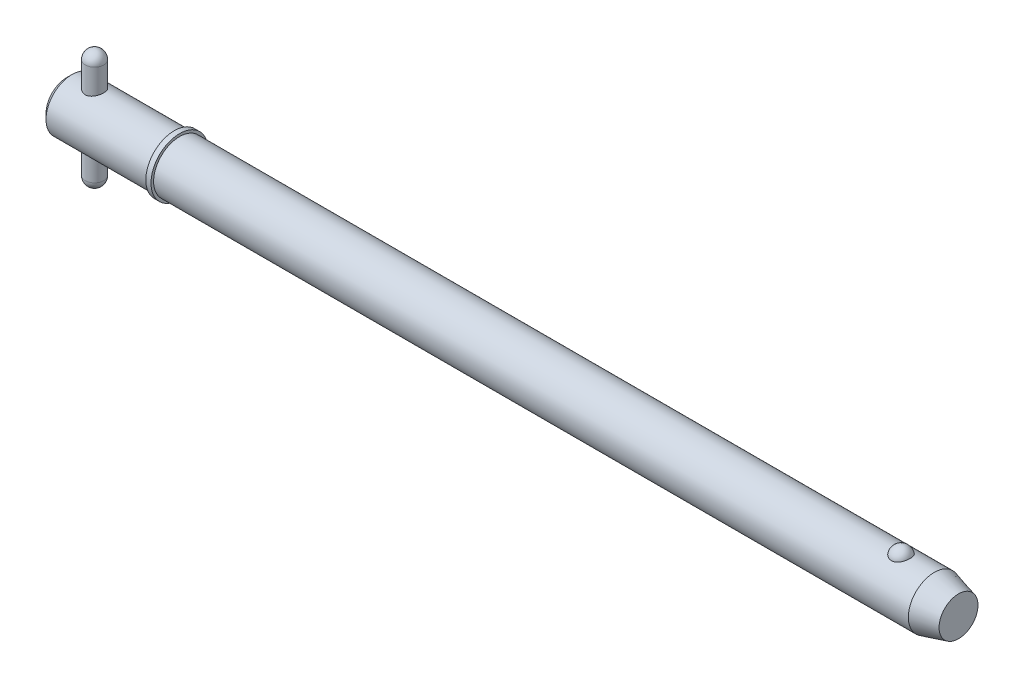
ISO-10303-21;
HEADER;
FILE_DESCRIPTION(('STEP AP214'),'2;1');
FILE_NAME('part.step','',(''),(''),'','','');
FILE_SCHEMA(('AUTOMOTIVE_DESIGN { 1 0 10303 214 1 1 1 1 }'));
ENDSEC;
DATA;
#1=APPLICATION_CONTEXT('core data for automotive mechanical design processes');
#2=APPLICATION_PROTOCOL_DEFINITION('international standard','automotive_design',2000,#1);
#3=PRODUCT_CONTEXT('',#1,'mechanical');
#4=PRODUCT('Part','Part','',(#3));
#5=PRODUCT_RELATED_PRODUCT_CATEGORY('part','',(#4));
#6=PRODUCT_DEFINITION_FORMATION('','',#4);
#7=PRODUCT_DEFINITION_CONTEXT('part definition',#1,'design');
#8=PRODUCT_DEFINITION('design','',#6,#7);
#9=PRODUCT_DEFINITION_SHAPE('','',#8);
#10=(LENGTH_UNIT() NAMED_UNIT(*) SI_UNIT(.MILLI.,.METRE.));
#11=(NAMED_UNIT(*) PLANE_ANGLE_UNIT() SI_UNIT($,.RADIAN.));
#12=(NAMED_UNIT(*) SI_UNIT($,.STERADIAN.) SOLID_ANGLE_UNIT());
#13=UNCERTAINTY_MEASURE_WITH_UNIT(LENGTH_MEASURE(1.E-05),#10,'distance_accuracy_value','');
#14=(GEOMETRIC_REPRESENTATION_CONTEXT(3) GLOBAL_UNCERTAINTY_ASSIGNED_CONTEXT((#13)) GLOBAL_UNIT_ASSIGNED_CONTEXT((#10,
#11,#12)) REPRESENTATION_CONTEXT('',''));
#15=CARTESIAN_POINT('',(0.,0.,0.));
#16=DIRECTION('',(0.,0.,1.));
#17=DIRECTION('',(1.,0.,0.));
#18=AXIS2_PLACEMENT_3D('',#15,#16,#17);
#19=CARTESIAN_POINT('',(5.94,12.7,0.));
#20=DIRECTION('',(0.,-1.,0.));
#21=DIRECTION('',(0.,0.,-1.));
#22=AXIS2_PLACEMENT_3D('',#19,#20,#21);
#23=CYLINDRICAL_SURFACE('',#22,1.98);
#24=CARTESIAN_POINT('',(5.94,-10.72,0.));
#25=DIRECTION('',(0.,-1.,0.));
#26=DIRECTION('',(0.,0.,-1.));
#27=AXIS2_PLACEMENT_3D('',#24,#25,#26);
#28=CIRCLE('',#27,1.98);
#29=CARTESIAN_POINT('',(5.94,-10.72,-1.98));
#30=VERTEX_POINT('',#29);
#31=EDGE_CURVE('P0_E10',#30,#30,#28,.F.);
#32=ORIENTED_EDGE('',*,*,#31,.T.);
#33=EDGE_LOOP('',(#32));
#34=FACE_BOUND('',#33,.T.);
#35=CARTESIAN_POINT('',(5.94,10.72,0.));
#36=DIRECTION('',(0.,-1.,0.));
#37=DIRECTION('',(0.,0.,-1.));
#38=AXIS2_PLACEMENT_3D('',#35,#36,#37);
#39=CIRCLE('',#38,1.98);
#40=CARTESIAN_POINT('',(5.94,10.72,-1.98));
#41=VERTEX_POINT('',#40);
#42=EDGE_CURVE('P0_E21',#41,#41,#39,.T.);
#43=ORIENTED_EDGE('',*,*,#42,.T.);
#44=EDGE_LOOP('',(#43));
#45=FACE_BOUND('',#44,.T.);
#46=ADVANCED_FACE('P0_F14',(#34,#45),#23,.T.);
#47=CARTESIAN_POINT('',(5.94,-10.72,0.));
#48=DIRECTION('',(0.,0.,1.));
#49=DIRECTION('',(1.,0.,0.));
#50=AXIS2_PLACEMENT_3D('',#47,#48,#49);
#51=SPHERICAL_SURFACE('',#50,1.98);
#52=CARTESIAN_POINT('',(5.94,-10.72,0.));
#53=DIRECTION('',(0.,-1.,0.));
#54=DIRECTION('',(0.,0.,-1.));
#55=AXIS2_PLACEMENT_3D('',#52,#53,#54);
#56=SPHERICAL_SURFACE('',#55,1.98);
#57=ORIENTED_EDGE('',*,*,#31,.F.);
#58=EDGE_LOOP('',(#57));
#59=FACE_BOUND('',#58,.T.);
#60=ADVANCED_FACE('P0_F29',(#59),#56,.T.);
#61=CARTESIAN_POINT('',(5.94,10.72,0.));
#62=DIRECTION('',(0.,0.,1.));
#63=DIRECTION('',(1.,0.,0.));
#64=AXIS2_PLACEMENT_3D('',#61,#62,#63);
#65=SPHERICAL_SURFACE('',#64,1.98);
#66=CARTESIAN_POINT('',(5.94,10.72,0.));
#67=DIRECTION('',(0.,-1.,0.));
#68=DIRECTION('',(0.,0.,-1.));
#69=AXIS2_PLACEMENT_3D('',#66,#67,#68);
#70=SPHERICAL_SURFACE('',#69,1.98);
#71=ORIENTED_EDGE('',*,*,#42,.F.);
#72=EDGE_LOOP('',(#71));
#73=FACE_BOUND('',#72,.T.);
#74=ADVANCED_FACE('P0_F16',(#73),#70,.T.);
#75=CLOSED_SHELL('',(#46,#60,#74));
#76=MANIFOLD_SOLID_BREP('P0_B1',#75);
#77=CARTESIAN_POINT('',(0.,0.,0.));
#78=DIRECTION('',(1.,0.,0.));
#79=DIRECTION('',(0.,0.,-1.));
#80=AXIS2_PLACEMENT_3D('',#77,#78,#79);
#81=CYLINDRICAL_SURFACE('',#80,5.555);
#82=CARTESIAN_POINT('',(185.617114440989,0.,0.));
#83=DIRECTION('',(1.,0.,0.));
#84=DIRECTION('',(0.,0.,-1.));
#85=AXIS2_PLACEMENT_3D('',#82,#83,#84);
#86=CIRCLE('',#85,5.555);
#87=CARTESIAN_POINT('',(185.617114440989,0.,-5.555));
#88=VERTEX_POINT('',#87);
#89=EDGE_CURVE('P1_E81',#88,#88,#86,.T.);
#90=ORIENTED_EDGE('',*,*,#89,.F.);
#91=EDGE_LOOP('',(#90));
#92=FACE_BOUND('',#91,.T.);
#93=CARTESIAN_POINT('',(24.13,0.,0.));
#94=DIRECTION('',(1.,0.,0.));
#95=DIRECTION('',(0.,0.,-1.));
#96=AXIS2_PLACEMENT_3D('',#93,#94,#95);
#97=CIRCLE('',#96,5.555);
#98=CARTESIAN_POINT('',(24.13,0.,-5.555));
#99=VERTEX_POINT('',#98);
#100=EDGE_CURVE('P1_E85',#99,#99,#97,.T.);
#101=ORIENTED_EDGE('',*,*,#100,.T.);
#102=EDGE_LOOP('',(#101));
#103=FACE_BOUND('',#102,.T.);
#104=CARTESIAN_POINT('',(178.498626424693,5.16741224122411,2.03859650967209));
#105=CARTESIAN_POINT('',(178.392949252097,5.16740893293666,2.03859990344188));
#106=CARTESIAN_POINT('',(178.28729894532,5.1707947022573,2.03008306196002));
#107=CARTESIAN_POINT('',(178.079141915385,5.18392795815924,1.99630721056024));
#108=CARTESIAN_POINT('',(177.976634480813,5.19367399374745,1.97105201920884));
#109=CARTESIAN_POINT('',(177.777771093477,5.2183916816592,1.90463997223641));
#110=CARTESIAN_POINT('',(177.681406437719,5.23335573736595,1.86350622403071));
#111=CARTESIAN_POINT('',(177.497080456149,5.26688076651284,1.76652592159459));
#112=CARTESIAN_POINT('',(177.409120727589,5.28544242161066,1.71067657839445));
#113=CARTESIAN_POINT('',(177.241265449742,5.32479845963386,1.58399959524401));
#114=CARTESIAN_POINT('',(177.16166564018,5.34564089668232,1.51279545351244));
#115=CARTESIAN_POINT('',(177.01512901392,5.38697258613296,1.35828584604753));
#116=CARTESIAN_POINT('',(176.948194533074,5.40746177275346,1.27497815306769));
#117=CARTESIAN_POINT('',(176.82561039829,5.44694508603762,1.0944029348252));
#118=CARTESIAN_POINT('',(176.770598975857,5.46583143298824,0.996677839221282));
#119=CARTESIAN_POINT('',(176.676937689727,5.49908030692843,0.792961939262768));
#120=CARTESIAN_POINT('',(176.638289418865,5.513442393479,0.686970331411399));
#121=CARTESIAN_POINT('',(176.577680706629,5.536358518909,0.468019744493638));
#122=CARTESIAN_POINT('',(176.555972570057,5.54482455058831,0.354981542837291));
#123=CARTESIAN_POINT('',(176.530636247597,5.55473324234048,0.126595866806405));
#124=CARTESIAN_POINT('',(176.527007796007,5.55617600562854,0.0112484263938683));
#125=CARTESIAN_POINT('',(176.537881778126,5.55189984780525,-0.218011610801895));
#126=CARTESIAN_POINT('',(176.552315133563,5.54620821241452,-0.331928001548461));
#127=CARTESIAN_POINT('',(176.598903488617,5.52828920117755,-0.55554427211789));
#128=CARTESIAN_POINT('',(176.631058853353,5.51606169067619,-0.665244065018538));
#129=CARTESIAN_POINT('',(176.712488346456,5.48630779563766,-0.877469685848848));
#130=CARTESIAN_POINT('',(176.761781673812,5.46877547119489,-0.9799873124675));
#131=CARTESIAN_POINT('',(176.876478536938,5.43024700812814,-1.17486975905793));
#132=CARTESIAN_POINT('',(176.941883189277,5.40925062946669,-1.26723387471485));
#133=CARTESIAN_POINT('',(177.087571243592,5.36600927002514,-1.43940133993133));
#134=CARTESIAN_POINT('',(177.167885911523,5.34376173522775,-1.51917763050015));
#135=CARTESIAN_POINT('',(177.341452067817,5.30057971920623,-1.66360338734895));
#136=CARTESIAN_POINT('',(177.434702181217,5.27964509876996,-1.72825445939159));
#137=CARTESIAN_POINT('',(177.629393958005,5.24205250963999,-1.83909478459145));
#138=CARTESIAN_POINT('',(177.730590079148,5.22530519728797,-1.885684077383));
#139=CARTESIAN_POINT('',(177.940155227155,5.19750919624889,-1.96100802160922));
#140=CARTESIAN_POINT('',(178.048521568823,5.18645838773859,-1.9897493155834));
#141=CARTESIAN_POINT('',(178.263498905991,5.17184410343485,-2.02742262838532));
#142=CARTESIAN_POINT('',(178.369925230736,5.16793282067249,-2.03727608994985));
#143=CARTESIAN_POINT('',(178.582992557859,5.16698995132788,-2.03966777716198));
#144=CARTESIAN_POINT('',(178.689633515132,5.16995704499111,-2.03220932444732));
#145=CARTESIAN_POINT('',(178.896773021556,5.18222383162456,-2.00071170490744));
#146=CARTESIAN_POINT('',(178.997359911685,5.19133213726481,-1.97717337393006));
#147=CARTESIAN_POINT('',(179.193014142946,5.21467637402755,-1.91475248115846));
#148=CARTESIAN_POINT('',(179.288081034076,5.22891272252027,-1.87586867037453));
#149=CARTESIAN_POINT('',(179.472371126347,5.26137066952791,-1.78282713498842));
#150=CARTESIAN_POINT('',(179.561419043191,5.27967329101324,-1.72835124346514));
#151=CARTESIAN_POINT('',(179.729288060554,5.3181741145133,-1.60597483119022));
#152=CARTESIAN_POINT('',(179.808106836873,5.33837274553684,-1.5380712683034));
#153=CARTESIAN_POINT('',(179.957515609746,5.37968287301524,-1.38688970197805));
#154=CARTESIAN_POINT('',(180.027505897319,5.40079011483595,-1.30301744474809));
#155=CARTESIAN_POINT('',(180.153012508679,5.44074401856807,-1.12458170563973));
#156=CARTESIAN_POINT('',(180.208526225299,5.4595902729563,-1.03001630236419));
#157=CARTESIAN_POINT('',(180.305550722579,5.49369849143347,-0.829439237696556));
#158=CARTESIAN_POINT('',(180.34654838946,5.50882422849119,-0.723155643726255));
#159=CARTESIAN_POINT('',(180.411125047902,5.53310911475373,-0.504772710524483));
#160=CARTESIAN_POINT('',(180.434703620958,5.54226812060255,-0.392673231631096));
#161=CARTESIAN_POINT('',(180.464013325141,5.55370358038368,-0.165459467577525));
#162=CARTESIAN_POINT('',(180.469688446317,5.55595843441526,-0.0503368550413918));
#163=CARTESIAN_POINT('',(180.462916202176,5.55329317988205,0.179288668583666));
#164=CARTESIAN_POINT('',(180.450469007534,5.54837313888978,0.293791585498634));
#165=CARTESIAN_POINT('',(180.407779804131,5.53189037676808,0.518526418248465));
#166=CARTESIAN_POINT('',(180.377598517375,5.5203503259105,0.628771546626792));
#167=CARTESIAN_POINT('',(180.300096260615,5.49182453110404,0.842318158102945));
#168=CARTESIAN_POINT('',(180.252774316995,5.47483847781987,0.945619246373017));
#169=CARTESIAN_POINT('',(180.141720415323,5.43710633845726,1.14281571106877));
#170=CARTESIAN_POINT('',(180.077921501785,5.41634501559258,1.23667048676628));
#171=CARTESIAN_POINT('',(179.935357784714,5.37334572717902,1.41185243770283));
#172=CARTESIAN_POINT('',(179.85659323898,5.35110778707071,1.49317982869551));
#173=CARTESIAN_POINT('',(179.686423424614,5.30779474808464,1.64049162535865));
#174=CARTESIAN_POINT('',(179.59510026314,5.28671324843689,1.70656877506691));
#175=CARTESIAN_POINT('',(179.401739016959,5.24804852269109,1.82201372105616));
#176=CARTESIAN_POINT('',(179.299700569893,5.23046541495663,1.87138095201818));
#177=CARTESIAN_POINT('',(179.083618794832,5.20042692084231,1.95335298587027));
#178=CARTESIAN_POINT('',(178.969260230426,5.18820192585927,1.98521734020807));
#179=CARTESIAN_POINT('',(178.736130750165,5.17169804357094,2.02783294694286));
#180=CARTESIAN_POINT('',(178.617361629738,5.16741595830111,2.03859269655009));
#181=CARTESIAN_POINT('',(178.498626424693,5.16741224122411,2.03859650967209));
#182=B_SPLINE_CURVE_WITH_KNOTS('',3,(#104,#105,#106,#107,#108,#109,#110,#111,#112,#113,#114,
#115,#116,#117,#118,#119,#120,#121,#122,#123,#124,#125,#126,#127,#128,#129,#130,#131,#132,#133,
#134,#135,#136,#137,#138,#139,#140,#141,#142,#143,#144,#145,#146,#147,#148,#149,#150,#151,#152,
#153,#154,#155,#156,#157,#158,#159,#160,#161,#162,#163,#164,#165,#166,#167,#168,#169,#170,#171,
#172,#173,#174,#175,#176,#177,#178,#179,#180,#181),.UNSPECIFIED.,.T.,.F.,(4,2,2,2,2,2,2,2,2,2,2,
2,2,2,2,2,2,2,2,2,2,2,2,2,2,2,2,2,2,2,2,2,2,2,2,2,2,2,4),(0.,0.316595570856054,
0.633118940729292,0.949183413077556,1.26530783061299,1.59030762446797,1.91536729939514,
2.2549582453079,2.59458224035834,2.93917283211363,3.2837583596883,3.62703002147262,
3.97030875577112,4.3139732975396,4.6576616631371,5.00207904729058,5.34645984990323,
5.68270547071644,6.01882587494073,6.33808403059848,6.65728093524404,6.96696376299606,
7.27667180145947,7.5932153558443,7.90983070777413,8.24210387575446,8.57443684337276,
8.91755896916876,9.26068933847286,9.60489211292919,9.94909164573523,10.292119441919,
10.6351667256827,10.9796305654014,11.3240884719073,11.6663928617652,12.0087088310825,
12.3645679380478,12.7202837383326),.UNSPECIFIED.);
#183=CARTESIAN_POINT('',(178.498626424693,5.16741224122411,2.03859650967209));
#184=VERTEX_POINT('',#183);
#185=EDGE_CURVE('P1_E35',#184,#184,#182,.T.);
#186=ORIENTED_EDGE('',*,*,#185,.T.);
#187=EDGE_LOOP('',(#186));
#188=FACE_BOUND('',#187,.T.);
#189=ADVANCED_FACE('P1_F13',(#92,#103,#188),#81,.T.);
#190=CARTESIAN_POINT('',(0.,0.,0.));
#191=DIRECTION('',(-1.,0.,0.));
#192=DIRECTION('',(0.,0.,1.));
#193=AXIS2_PLACEMENT_3D('',#190,#191,#192);
#194=PLANE('',#193);
#195=CARTESIAN_POINT('',(0.,0.,0.));
#196=DIRECTION('',(1.,0.,0.));
#197=DIRECTION('',(0.,0.,-1.));
#198=AXIS2_PLACEMENT_3D('',#195,#196,#197);
#199=CIRCLE('',#198,4.444);
#200=CARTESIAN_POINT('',(0.,0.,-4.444));
#201=VERTEX_POINT('',#200);
#202=EDGE_CURVE('P1_E9',#201,#201,#199,.T.);
#203=ORIENTED_EDGE('',*,*,#202,.F.);
#204=EDGE_LOOP('',(#203));
#205=FACE_BOUND('',#204,.T.);
#206=ADVANCED_FACE('P1_F15',(#205),#194,.T.);
#207=CARTESIAN_POINT('',(1.111,0.,0.));
#208=DIRECTION('',(1.,0.,0.));
#209=DIRECTION('',(0.,0.,-1.));
#210=AXIS2_PLACEMENT_3D('',#207,#208,#209);
#211=CONICAL_SURFACE('',#210,5.555,0.78539816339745);
#212=ORIENTED_EDGE('',*,*,#202,.T.);
#213=EDGE_LOOP('',(#212));
#214=FACE_BOUND('',#213,.T.);
#215=CARTESIAN_POINT('',(1.111,0.,0.));
#216=DIRECTION('',(1.,0.,0.));
#217=DIRECTION('',(0.,0.,-1.));
#218=AXIS2_PLACEMENT_3D('',#215,#216,#217);
#219=CIRCLE('',#218,5.555);
#220=CARTESIAN_POINT('',(1.111,0.,-5.555));
#221=VERTEX_POINT('',#220);
#222=EDGE_CURVE('P1_E26',#221,#221,#219,.T.);
#223=ORIENTED_EDGE('',*,*,#222,.F.);
#224=EDGE_LOOP('',(#223));
#225=FACE_BOUND('',#224,.T.);
#226=ADVANCED_FACE('P1_F77',(#214,#225),#211,.T.);
#227=CARTESIAN_POINT('',(0.,0.,0.));
#228=DIRECTION('',(1.,0.,0.));
#229=DIRECTION('',(0.,0.,-1.));
#230=AXIS2_PLACEMENT_3D('',#227,#228,#229);
#231=CYLINDRICAL_SURFACE('',#230,5.555);
#232=CARTESIAN_POINT('',(5.94,-5.19014691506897,1.98));
#233=CARTESIAN_POINT('',(5.83264687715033,-5.19014494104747,1.98000226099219));
#234=CARTESIAN_POINT('',(5.7253094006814,-5.19351395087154,1.97123988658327));
#235=CARTESIAN_POINT('',(5.51384517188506,-5.20654291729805,1.93656219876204));
#236=CARTESIAN_POINT('',(5.40971858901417,-5.21620320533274,1.91064598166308));
#237=CARTESIAN_POINT('',(5.20778082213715,-5.24058443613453,1.84271148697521));
#238=CARTESIAN_POINT('',(5.10995634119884,-5.25529427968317,1.80072850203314));
#239=CARTESIAN_POINT('',(4.92270352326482,-5.28810012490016,1.70197537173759));
#240=CARTESIAN_POINT('',(4.83327743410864,-5.3061970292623,1.64520128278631));
#241=CARTESIAN_POINT('',(4.66135184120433,-5.34464714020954,1.51575187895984));
#242=CARTESIAN_POINT('',(4.57928277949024,-5.36506222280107,1.44252311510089));
#243=CARTESIAN_POINT('',(4.42829115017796,-5.40532920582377,1.28342047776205));
#244=CARTESIAN_POINT('',(4.35937105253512,-5.42518099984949,1.19754423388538));
#245=CARTESIAN_POINT('',(4.23461605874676,-5.46281133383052,1.01237205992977));
#246=CARTESIAN_POINT('',(4.17924129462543,-5.48050875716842,0.912748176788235));
#247=CARTESIAN_POINT('',(4.0862117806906,-5.51109938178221,0.70485824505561));
#248=CARTESIAN_POINT('',(4.0485515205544,-5.52399407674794,0.596594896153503));
#249=CARTESIAN_POINT('',(3.99350662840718,-5.54308759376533,0.379019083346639));
#250=CARTESIAN_POINT('',(3.97538263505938,-5.54952987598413,0.269915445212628));
#251=CARTESIAN_POINT('',(3.95756405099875,-5.55586205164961,0.0500378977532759));
#252=CARTESIAN_POINT('',(3.95786404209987,-5.55575387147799,-0.060735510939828));
#253=CARTESIAN_POINT('',(3.97643665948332,-5.54915684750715,-0.275539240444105));
#254=CARTESIAN_POINT('',(3.99390415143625,-5.54295384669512,-0.379649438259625));
#255=CARTESIAN_POINT('',(4.0449721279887,-5.52523170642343,-0.583350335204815));
#256=CARTESIAN_POINT('',(4.07857373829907,-5.51371219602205,-0.682940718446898));
#257=CARTESIAN_POINT('',(4.16137312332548,-5.4863099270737,-0.876423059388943));
#258=CARTESIAN_POINT('',(4.2107826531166,-5.47036834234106,-0.970215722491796));
#259=CARTESIAN_POINT('',(4.32361427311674,-5.43575653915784,-1.1484017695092));
#260=CARTESIAN_POINT('',(4.38704062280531,-5.41708549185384,-1.23279228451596));
#261=CARTESIAN_POINT('',(4.53006791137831,-5.37778429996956,-1.39454579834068));
#262=CARTESIAN_POINT('',(4.61035105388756,-5.35710277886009,-1.4712940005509));
#263=CARTESIAN_POINT('',(4.78279835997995,-5.31692766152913,-1.6104545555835));
#264=CARTESIAN_POINT('',(4.874964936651,-5.29743430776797,-1.67286398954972));
#265=CARTESIAN_POINT('',(5.07076688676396,-5.26153775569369,-1.78259698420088));
#266=CARTESIAN_POINT('',(5.17458163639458,-5.24519780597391,-1.8296227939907));
#267=CARTESIAN_POINT('',(5.38938990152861,-5.21818744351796,-1.90530278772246));
#268=CARTESIAN_POINT('',(5.50037985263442,-5.20751423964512,-1.93396601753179));
#269=CARTESIAN_POINT('',(5.72036376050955,-5.19369176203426,-1.97077654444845));
#270=CARTESIAN_POINT('',(5.82917370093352,-5.19018851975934,-1.97989015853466));
#271=CARTESIAN_POINT('',(6.04680100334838,-5.19010609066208,-1.98010779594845));
#272=CARTESIAN_POINT('',(6.15561835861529,-5.19352540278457,-1.97121572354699));
#273=CARTESIAN_POINT('',(6.36548036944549,-5.20654623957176,-1.93654727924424));
#274=CARTESIAN_POINT('',(6.46666051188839,-5.21588705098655,-1.91148218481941));
#275=CARTESIAN_POINT('',(6.66334537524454,-5.23939939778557,-1.84605494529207));
#276=CARTESIAN_POINT('',(6.75884899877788,-5.25357186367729,-1.8056898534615));
#277=CARTESIAN_POINT('',(6.94517989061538,-5.28576258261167,-1.70921153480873));
#278=CARTESIAN_POINT('',(7.03572661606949,-5.30389804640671,-1.65259670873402));
#279=CARTESIAN_POINT('',(7.20638087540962,-5.34176077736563,-1.52577523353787));
#280=CARTESIAN_POINT('',(7.28648490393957,-5.36148857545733,-1.45556404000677));
#281=CARTESIAN_POINT('',(7.43864697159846,-5.40165494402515,-1.2988614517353));
#282=CARTESIAN_POINT('',(7.50999887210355,-5.42207106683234,-1.21167640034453));
#283=CARTESIAN_POINT('',(7.63712639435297,-5.46023601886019,-1.026066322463));
#284=CARTESIAN_POINT('',(7.69290228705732,-5.47798489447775,-0.927641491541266));
#285=CARTESIAN_POINT('',(7.78684673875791,-5.50876590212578,-0.722633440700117));
#286=CARTESIAN_POINT('',(7.82510508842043,-5.52182201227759,-0.616095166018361));
#287=CARTESIAN_POINT('',(7.88297051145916,-5.54184206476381,-0.397530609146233));
#288=CARTESIAN_POINT('',(7.90258540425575,-5.5488085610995,-0.285506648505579));
#289=CARTESIAN_POINT('',(7.9218262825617,-5.55564472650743,-0.065566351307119));
#290=CARTESIAN_POINT('',(7.92245987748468,-5.55587212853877,0.0422515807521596));
#291=CARTESIAN_POINT('',(7.90626329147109,-5.55011340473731,0.256387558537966));
#292=CARTESIAN_POINT('',(7.88943488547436,-5.54412791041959,0.362705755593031));
#293=CARTESIAN_POINT('',(7.83948457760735,-5.52676548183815,0.568649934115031));
#294=CARTESIAN_POINT('',(7.8067003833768,-5.51550046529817,0.668367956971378));
#295=CARTESIAN_POINT('',(7.72609369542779,-5.48874437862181,0.860911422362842));
#296=CARTESIAN_POINT('',(7.67826838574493,-5.47325251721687,0.953735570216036));
#297=CARTESIAN_POINT('',(7.56675024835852,-5.43884382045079,1.13391068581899));
#298=CARTESIAN_POINT('',(7.50249968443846,-5.41981485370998,1.22089468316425));
#299=CARTESIAN_POINT('',(7.36086495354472,-5.38069275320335,1.38316665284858));
#300=CARTESIAN_POINT('',(7.28347630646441,-5.36059925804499,1.45845061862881));
#301=CARTESIAN_POINT('',(7.11347587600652,-5.32048380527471,1.59876646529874));
#302=CARTESIAN_POINT('',(7.02032386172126,-5.30050854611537,1.66315951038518));
#303=CARTESIAN_POINT('',(6.82388804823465,-5.26398994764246,1.77536801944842));
#304=CARTESIAN_POINT('',(6.7206049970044,-5.24744635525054,1.82318470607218));
#305=CARTESIAN_POINT('',(6.50639706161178,-5.21987969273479,1.90068230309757));
#306=CARTESIAN_POINT('',(6.3954529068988,-5.20887116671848,1.93031547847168));
#307=CARTESIAN_POINT('',(6.16966522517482,-5.19400760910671,1.96996824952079));
#308=CARTESIAN_POINT('',(6.05482366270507,-5.19014902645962,1.97999758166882));
#309=CARTESIAN_POINT('',(5.94,-5.19014691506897,1.98));
#310=B_SPLINE_CURVE_WITH_KNOTS('',3,(#232,#233,#234,#235,#236,#237,#238,#239,#240,#241,#242,
#243,#244,#245,#246,#247,#248,#249,#250,#251,#252,#253,#254,#255,#256,#257,#258,#259,#260,#261,
#262,#263,#264,#265,#266,#267,#268,#269,#270,#271,#272,#273,#274,#275,#276,#277,#278,#279,#280,
#281,#282,#283,#284,#285,#286,#287,#288,#289,#290,#291,#292,#293,#294,#295,#296,#297,#298,#299,
#300,#301,#302,#303,#304,#305,#306,#307,#308,#309),.UNSPECIFIED.,.T.,.F.,(4,2,2,2,2,2,2,2,2,2,2,
2,2,2,2,2,2,2,2,2,2,2,2,2,2,2,2,2,2,2,2,2,2,2,2,2,2,2,4),(0.,0.321632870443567,
0.643282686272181,0.964229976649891,1.28526292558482,1.61937087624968,1.9535415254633,
2.29784481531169,2.64204093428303,2.97269632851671,3.30325448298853,3.61901541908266,
3.93479838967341,4.25500220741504,4.57530346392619,4.91268648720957,5.25013812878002,
5.59378026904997,5.93725299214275,6.26331481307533,6.58930593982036,6.90185604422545,
7.21446637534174,7.53801472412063,7.86167140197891,8.20353561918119,8.54539388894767,
8.88547970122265,9.22542281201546,9.54728637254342,9.86911722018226,10.1844146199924,
10.4997710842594,10.827730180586,11.1558013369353,11.499115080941,11.8424034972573,
12.1865892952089,12.5306041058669),.UNSPECIFIED.);
#311=CARTESIAN_POINT('',(5.94,-5.19014691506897,1.98));
#312=VERTEX_POINT('',#311);
#313=EDGE_CURVE('P1_E17',#312,#312,#310,.T.);
#314=ORIENTED_EDGE('',*,*,#313,.F.);
#315=EDGE_LOOP('',(#314));
#316=FACE_BOUND('',#315,.T.);
#317=CARTESIAN_POINT('',(5.94,5.19014691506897,1.98));
#318=CARTESIAN_POINT('',(6.04735312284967,5.19014494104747,1.98000226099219));
#319=CARTESIAN_POINT('',(6.1546905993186,5.19351395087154,1.97123988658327));
#320=CARTESIAN_POINT('',(6.36615482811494,5.20654291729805,1.93656219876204));
#321=CARTESIAN_POINT('',(6.47028141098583,5.21620320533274,1.91064598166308));
#322=CARTESIAN_POINT('',(6.67221917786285,5.24058443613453,1.84271148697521));
#323=CARTESIAN_POINT('',(6.77004365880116,5.25529427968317,1.80072850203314));
#324=CARTESIAN_POINT('',(6.95729647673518,5.28810012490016,1.70197537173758));
#325=CARTESIAN_POINT('',(7.04672256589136,5.3061970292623,1.64520128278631));
#326=CARTESIAN_POINT('',(7.21864815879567,5.34464714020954,1.51575187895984));
#327=CARTESIAN_POINT('',(7.30071722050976,5.36506222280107,1.44252311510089));
#328=CARTESIAN_POINT('',(7.45170884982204,5.40532920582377,1.28342047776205));
#329=CARTESIAN_POINT('',(7.52062894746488,5.42518099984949,1.19754423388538));
#330=CARTESIAN_POINT('',(7.64538394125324,5.46281133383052,1.01237205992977));
#331=CARTESIAN_POINT('',(7.70075870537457,5.48050875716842,0.912748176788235));
#332=CARTESIAN_POINT('',(7.7937882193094,5.51109938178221,0.704858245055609));
#333=CARTESIAN_POINT('',(7.8314484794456,5.52399407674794,0.596594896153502));
#334=CARTESIAN_POINT('',(7.88649337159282,5.54308759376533,0.379019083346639));
#335=CARTESIAN_POINT('',(7.90461736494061,5.54952987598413,0.269915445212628));
#336=CARTESIAN_POINT('',(7.92243594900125,5.55586205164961,0.0500378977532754));
#337=CARTESIAN_POINT('',(7.92213595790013,5.55575387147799,-0.0607355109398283));
#338=CARTESIAN_POINT('',(7.90356334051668,5.54915684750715,-0.275539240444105));
#339=CARTESIAN_POINT('',(7.88609584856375,5.54295384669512,-0.379649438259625));
#340=CARTESIAN_POINT('',(7.8350278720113,5.52523170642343,-0.583350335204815));
#341=CARTESIAN_POINT('',(7.80142626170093,5.51371219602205,-0.682940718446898));
#342=CARTESIAN_POINT('',(7.71862687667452,5.4863099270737,-0.876423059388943));
#343=CARTESIAN_POINT('',(7.6692173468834,5.47036834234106,-0.970215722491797));
#344=CARTESIAN_POINT('',(7.55638572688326,5.43575653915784,-1.1484017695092));
#345=CARTESIAN_POINT('',(7.49295937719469,5.41708549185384,-1.23279228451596));
#346=CARTESIAN_POINT('',(7.34993208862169,5.37778429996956,-1.39454579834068));
#347=CARTESIAN_POINT('',(7.26964894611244,5.35710277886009,-1.4712940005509));
#348=CARTESIAN_POINT('',(7.09720164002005,5.31692766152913,-1.6104545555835));
#349=CARTESIAN_POINT('',(7.00503506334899,5.29743430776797,-1.67286398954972));
#350=CARTESIAN_POINT('',(6.80923311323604,5.26153775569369,-1.78259698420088));
#351=CARTESIAN_POINT('',(6.70541836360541,5.24519780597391,-1.8296227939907));
#352=CARTESIAN_POINT('',(6.49061009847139,5.21818744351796,-1.90530278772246));
#353=CARTESIAN_POINT('',(6.37962014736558,5.20751423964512,-1.93396601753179));
#354=CARTESIAN_POINT('',(6.15963623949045,5.19369176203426,-1.97077654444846));
#355=CARTESIAN_POINT('',(6.05082629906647,5.19018851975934,-1.97989015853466));
#356=CARTESIAN_POINT('',(5.83319899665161,5.19010609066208,-1.98010779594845));
#357=CARTESIAN_POINT('',(5.7243816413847,5.19352540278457,-1.97121572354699));
#358=CARTESIAN_POINT('',(5.5145196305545,5.20654623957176,-1.93654727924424));
#359=CARTESIAN_POINT('',(5.4133394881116,5.21588705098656,-1.91148218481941));
#360=CARTESIAN_POINT('',(5.21665462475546,5.23939939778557,-1.84605494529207));
#361=CARTESIAN_POINT('',(5.12115100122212,5.25357186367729,-1.8056898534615));
#362=CARTESIAN_POINT('',(4.93482010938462,5.28576258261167,-1.70921153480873));
#363=CARTESIAN_POINT('',(4.84427338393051,5.30389804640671,-1.65259670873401));
#364=CARTESIAN_POINT('',(4.67361912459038,5.34176077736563,-1.52577523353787));
#365=CARTESIAN_POINT('',(4.59351509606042,5.36148857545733,-1.45556404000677));
#366=CARTESIAN_POINT('',(4.44135302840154,5.40165494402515,-1.2988614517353));
#367=CARTESIAN_POINT('',(4.37000112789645,5.42207106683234,-1.21167640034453));
#368=CARTESIAN_POINT('',(4.24287360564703,5.46023601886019,-1.026066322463));
#369=CARTESIAN_POINT('',(4.18709771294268,5.47798489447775,-0.927641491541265));
#370=CARTESIAN_POINT('',(4.09315326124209,5.50876590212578,-0.722633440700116));
#371=CARTESIAN_POINT('',(4.05489491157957,5.52182201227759,-0.61609516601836));
#372=CARTESIAN_POINT('',(3.99702948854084,5.54184206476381,-0.397530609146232));
#373=CARTESIAN_POINT('',(3.97741459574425,5.5488085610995,-0.285506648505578));
#374=CARTESIAN_POINT('',(3.9581737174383,5.55564472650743,-0.0655663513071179));
#375=CARTESIAN_POINT('',(3.95754012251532,5.55587212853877,0.0422515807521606));
#376=CARTESIAN_POINT('',(3.97373670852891,5.55011340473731,0.256387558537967));
#377=CARTESIAN_POINT('',(3.99056511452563,5.54412791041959,0.362705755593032));
#378=CARTESIAN_POINT('',(4.04051542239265,5.52676548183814,0.568649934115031));
#379=CARTESIAN_POINT('',(4.07329961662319,5.51550046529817,0.668367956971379));
#380=CARTESIAN_POINT('',(4.15390630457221,5.48874437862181,0.860911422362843));
#381=CARTESIAN_POINT('',(4.20173161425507,5.47325251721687,0.953735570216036));
#382=CARTESIAN_POINT('',(4.31324975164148,5.43884382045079,1.13391068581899));
#383=CARTESIAN_POINT('',(4.37750031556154,5.41981485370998,1.22089468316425));
#384=CARTESIAN_POINT('',(4.51913504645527,5.38069275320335,1.38316665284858));
#385=CARTESIAN_POINT('',(4.59652369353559,5.36059925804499,1.45845061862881));
#386=CARTESIAN_POINT('',(4.76652412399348,5.32048380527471,1.59876646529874));
#387=CARTESIAN_POINT('',(4.85967613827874,5.30050854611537,1.66315951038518));
#388=CARTESIAN_POINT('',(5.05611195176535,5.26398994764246,1.77536801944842));
#389=CARTESIAN_POINT('',(5.1593950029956,5.24744635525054,1.82318470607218));
#390=CARTESIAN_POINT('',(5.37360293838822,5.21987969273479,1.90068230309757));
#391=CARTESIAN_POINT('',(5.4845470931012,5.20887116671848,1.93031547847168));
#392=CARTESIAN_POINT('',(5.71033477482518,5.19400760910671,1.96996824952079));
#393=CARTESIAN_POINT('',(5.82517633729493,5.19014902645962,1.97999758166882));
#394=CARTESIAN_POINT('',(5.94,5.19014691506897,1.98));
#395=B_SPLINE_CURVE_WITH_KNOTS('',3,(#317,#318,#319,#320,#321,#322,#323,#324,#325,#326,#327,
#328,#329,#330,#331,#332,#333,#334,#335,#336,#337,#338,#339,#340,#341,#342,#343,#344,#345,#346,
#347,#348,#349,#350,#351,#352,#353,#354,#355,#356,#357,#358,#359,#360,#361,#362,#363,#364,#365,
#366,#367,#368,#369,#370,#371,#372,#373,#374,#375,#376,#377,#378,#379,#380,#381,#382,#383,#384,
#385,#386,#387,#388,#389,#390,#391,#392,#393,#394),.UNSPECIFIED.,.T.,.F.,(4,2,2,2,2,2,2,2,2,2,2,
2,2,2,2,2,2,2,2,2,2,2,2,2,2,2,2,2,2,2,2,2,2,2,2,2,2,2,4),(0.,0.321632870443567,
0.643282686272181,0.964229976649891,1.28526292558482,1.61937087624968,1.9535415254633,
2.29784481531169,2.64204093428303,2.97269632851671,3.30325448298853,3.61901541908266,
3.93479838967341,4.25500220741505,4.57530346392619,4.91268648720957,5.25013812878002,
5.59378026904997,5.93725299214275,6.26331481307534,6.58930593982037,6.90185604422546,
7.21446637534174,7.53801472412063,7.86167140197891,8.20353561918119,8.54539388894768,
8.88547970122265,9.22542281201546,9.54728637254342,9.86911722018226,10.1844146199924,
10.4997710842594,10.827730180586,11.1558013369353,11.499115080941,11.8424034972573,
12.1865892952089,12.5306041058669),.UNSPECIFIED.);
#396=CARTESIAN_POINT('',(5.94,5.19014691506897,1.98));
#397=VERTEX_POINT('',#396);
#398=EDGE_CURVE('P1_E43',#397,#397,#395,.T.);
#399=ORIENTED_EDGE('',*,*,#398,.F.);
#400=EDGE_LOOP('',(#399));
#401=FACE_BOUND('',#400,.T.);
#402=ORIENTED_EDGE('',*,*,#222,.T.);
#403=EDGE_LOOP('',(#402));
#404=FACE_BOUND('',#403,.T.);
#405=CARTESIAN_POINT('',(23.019,0.,0.));
#406=DIRECTION('',(1.,0.,0.));
#407=DIRECTION('',(0.,0.,-1.));
#408=AXIS2_PLACEMENT_3D('',#405,#406,#407);
#409=CIRCLE('',#408,5.555);
#410=CARTESIAN_POINT('',(23.019,0.,-5.555));
#411=VERTEX_POINT('',#410);
#412=EDGE_CURVE('P1_E31',#411,#411,#409,.T.);
#413=ORIENTED_EDGE('',*,*,#412,.F.);
#414=EDGE_LOOP('',(#413));
#415=FACE_BOUND('',#414,.T.);
#416=ADVANCED_FACE('P1_F103',(#316,#401,#404,#415),#231,.T.);
#417=CARTESIAN_POINT('',(23.019,5.555,0.));
#418=DIRECTION('',(-1.,0.,0.));
#419=DIRECTION('',(0.,0.,1.));
#420=AXIS2_PLACEMENT_3D('',#417,#418,#419);
#421=PLANE('',#420);
#422=ORIENTED_EDGE('',*,*,#412,.T.);
#423=EDGE_LOOP('',(#422));
#424=FACE_BOUND('',#423,.T.);
#425=CARTESIAN_POINT('',(23.019,0.,0.));
#426=DIRECTION('',(1.,0.,0.));
#427=DIRECTION('',(0.,0.,-1.));
#428=AXIS2_PLACEMENT_3D('',#425,#426,#427);
#429=CIRCLE('',#428,6.1105);
#430=CARTESIAN_POINT('',(23.019,0.,-6.1105));
#431=VERTEX_POINT('',#430);
#432=EDGE_CURVE('P1_E91',#431,#431,#429,.T.);
#433=ORIENTED_EDGE('',*,*,#432,.F.);
#434=EDGE_LOOP('',(#433));
#435=FACE_BOUND('',#434,.T.);
#436=ADVANCED_FACE('P1_F100',(#424,#435),#421,.T.);
#437=CARTESIAN_POINT('',(0.,0.,0.));
#438=DIRECTION('',(1.,0.,0.));
#439=DIRECTION('',(0.,0.,-1.));
#440=AXIS2_PLACEMENT_3D('',#437,#438,#439);
#441=CYLINDRICAL_SURFACE('',#440,6.1105);
#442=ORIENTED_EDGE('',*,*,#432,.T.);
#443=EDGE_LOOP('',(#442));
#444=FACE_BOUND('',#443,.T.);
#445=CARTESIAN_POINT('',(24.13,0.,0.));
#446=DIRECTION('',(1.,0.,0.));
#447=DIRECTION('',(0.,0.,-1.));
#448=AXIS2_PLACEMENT_3D('',#445,#446,#447);
#449=CIRCLE('',#448,6.1105);
#450=CARTESIAN_POINT('',(24.13,0.,-6.1105));
#451=VERTEX_POINT('',#450);
#452=EDGE_CURVE('P1_E88',#451,#451,#449,.T.);
#453=ORIENTED_EDGE('',*,*,#452,.F.);
#454=EDGE_LOOP('',(#453));
#455=FACE_BOUND('',#454,.T.);
#456=ADVANCED_FACE('P1_F68',(#444,#455),#441,.T.);
#457=CARTESIAN_POINT('',(24.13,6.1105,0.));
#458=DIRECTION('',(1.,0.,0.));
#459=DIRECTION('',(0.,0.,-1.));
#460=AXIS2_PLACEMENT_3D('',#457,#458,#459);
#461=PLANE('',#460);
#462=ORIENTED_EDGE('',*,*,#452,.T.);
#463=EDGE_LOOP('',(#462));
#464=FACE_BOUND('',#463,.T.);
#465=ORIENTED_EDGE('',*,*,#100,.F.);
#466=EDGE_LOOP('',(#465));
#467=FACE_BOUND('',#466,.T.);
#468=ADVANCED_FACE('P1_F62',(#464,#467),#461,.T.);
#469=CARTESIAN_POINT('',(190.8,0.,0.));
#470=DIRECTION('',(-1.,0.,0.));
#471=DIRECTION('',(0.,0.,1.));
#472=AXIS2_PLACEMENT_3D('',#469,#470,#471);
#473=CONICAL_SURFACE('',#472,4.16625000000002,0.261799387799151);
#474=ORIENTED_EDGE('',*,*,#89,.T.);
#475=EDGE_LOOP('',(#474));
#476=FACE_BOUND('',#475,.T.);
#477=CARTESIAN_POINT('',(190.8,0.,0.));
#478=DIRECTION('',(1.,0.,0.));
#479=DIRECTION('',(0.,0.,-1.));
#480=AXIS2_PLACEMENT_3D('',#477,#478,#479);
#481=CIRCLE('',#480,4.16625000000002);
#482=CARTESIAN_POINT('',(190.8,0.,-4.16625000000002));
#483=VERTEX_POINT('',#482);
#484=EDGE_CURVE('P1_E42',#483,#483,#481,.T.);
#485=ORIENTED_EDGE('',*,*,#484,.F.);
#486=EDGE_LOOP('',(#485));
#487=FACE_BOUND('',#486,.T.);
#488=ADVANCED_FACE('P1_F59',(#476,#487),#473,.T.);
#489=CARTESIAN_POINT('',(190.8,4.16625000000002,0.));
#490=DIRECTION('',(1.,0.,0.));
#491=DIRECTION('',(0.,0.,-1.));
#492=AXIS2_PLACEMENT_3D('',#489,#490,#491);
#493=PLANE('',#492);
#494=ORIENTED_EDGE('',*,*,#484,.T.);
#495=EDGE_LOOP('',(#494));
#496=FACE_BOUND('',#495,.T.);
#497=ADVANCED_FACE('P1_F55',(#496),#493,.T.);
#498=CARTESIAN_POINT('',(178.498626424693,4.9995,0.));
#499=DIRECTION('',(-1.,0.,0.));
#500=DIRECTION('',(0.,1.,0.));
#501=AXIS2_PLACEMENT_3D('',#498,#499,#500);
#502=SPHERICAL_SURFACE('',#501,2.04550000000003);
#503=ORIENTED_EDGE('',*,*,#185,.F.);
#504=EDGE_LOOP('',(#503));
#505=FACE_BOUND('',#504,.T.);
#506=ADVANCED_FACE('P1_F50',(#505),#502,.T.);
#507=CARTESIAN_POINT('',(5.94,-6.1105,0.));
#508=DIRECTION('',(0.,1.,0.));
#509=DIRECTION('',(0.,0.,1.));
#510=AXIS2_PLACEMENT_3D('',#507,#508,#509);
#511=CYLINDRICAL_SURFACE('',#510,1.98);
#512=ORIENTED_EDGE('',*,*,#313,.T.);
#513=EDGE_LOOP('',(#512));
#514=FACE_BOUND('',#513,.T.);
#515=ORIENTED_EDGE('',*,*,#398,.T.);
#516=EDGE_LOOP('',(#515));
#517=FACE_BOUND('',#516,.T.);
#518=ADVANCED_FACE('P1_F54',(#514,#517),#511,.F.);
#519=CLOSED_SHELL('',(#189,#206,#226,#416,#436,#456,#468,#488,#497,#506,#518));
#520=MANIFOLD_SOLID_BREP('P1_B1',#519);
#521=ADVANCED_BREP_SHAPE_REPRESENTATION('',(#18,#76,#520),#14);
#522=SHAPE_DEFINITION_REPRESENTATION(#9,#521);
ENDSEC;
END-ISO-10303-21;
